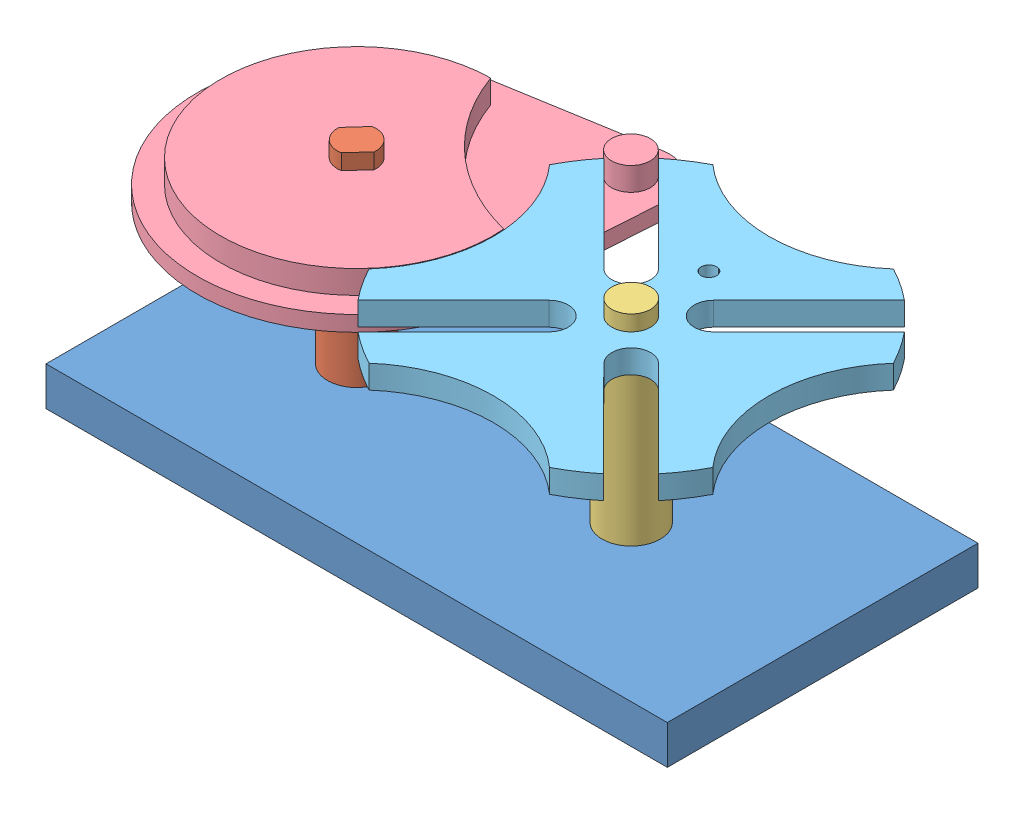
SolidWorks assembly Assem1.sldasm, configuration ﾃﾞﾌｫﾙﾄ (file format 3400). Lengths in mm.
Overall size (177.91 80 129.91).
5 component instances, 5 part files, 10 mates.
Components (placement in the parent):
- base-1: base.SLDPRT [ﾃﾞﾌｫﾙﾄ] at origin size (160 10 80)
- jiku_a-1: jiku_a.SLDPRT [ﾃﾞﾌｫﾙﾄ] at (40 60 -40) x (0 -1 0) z (0.741347 0 0.671122) size (80 15 15)
- jiku_b-1: jiku_b.SLDPRT [ﾃﾞﾌｫﾙﾄ] at (110.7 0 -40) x (0 1 0) z (0 0 1) size (60 15 15)
- pinwheel-1: pinwheel.SLDPRT [ﾃﾞﾌｫﾙﾄ] at (40 46 -40) x (0.671122 0 -0.741347) z (0.741347 0 0.671122) size (101 10 82)
- genevawheel-1: genevawheel.SLDPRT [ﾃﾞﾌｫﾙﾄ] at (110.7 50 -40) x (1 0 0.000086) z (-0.000086 0 1) size (88.54 6 88.54)
Mates (geometry in assembly coordinates):
- 一致1: coincident anti-aligned: axis of base-1; axis of jiku_a-1
- 一致2: coincident anti-aligned: plane of base-1 through (0 10 -80) normal (0 1 0); plane of jiku_a-1 through (40 10 -40) normal (0 -1 0)
- 一致3: coincident anti-aligned: axis of base-1; axis of jiku_b-1
- 一致4: coincident anti-aligned: plane of base-1 through (107.7 0 -44) normal (0 0 1); plane of jiku_b-1 through (107.7 10 -44) normal (0 0 -1)
- 一致5: coincident anti-aligned: plane of base-1 through (0 10 -80) normal (0 1 0); plane of jiku_b-1 through (110.7 10 -40) normal (0 -1 0)
- 一致6: coincident anti-aligned: axis of jiku_a-1; axis of pinwheel-1
- 一致7: coincident anti-aligned: plane of jiku_a-1 through (39.048 46 -44.9085) normal (-0.741347 0 -0.671122); plane of pinwheel-1 through (35.0212 46 -40.4604) normal (0.741347 0 0.671122)
- 一致8: coincident anti-aligned: plane of jiku_a-1 through (40 46 -40) normal (0 1 0); plane of pinwheel-1 through (40 46 -40) normal (0 -1 0)
- 一致9: coincident anti-aligned: axis of jiku_b-1; axis of genevawheel-1
- 一致10: coincident anti-aligned: plane of jiku_b-1 through (110.7 50 -40) normal (0 1 0); plane of genevawheel-1 through (110.7 50 -40) normal (0 -1 0)
